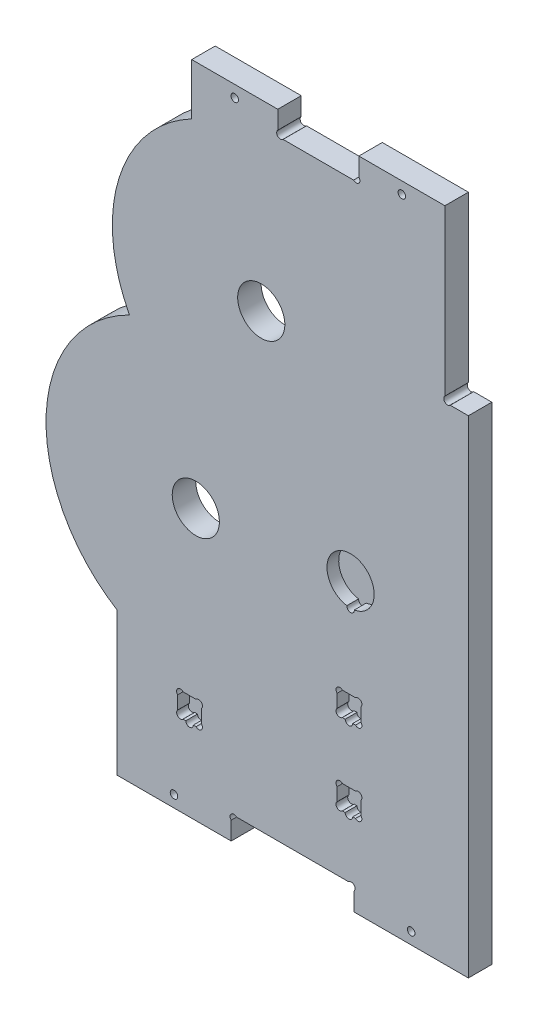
from build123d import *

# Parameters (mm, degrees)
BOSS_EXTRU_1_DEPTH      = 10
ESQUISSE2_R             = 10.05
ENL_V_MAT_EXTRU_1_DEPTH = 30
ENL_V_MAT_EXTRU_3_REACH = 172.898
ESQUISSE5_R             = 10.05
ESQUISSE6_R             = 1.6
ENL_V_MAT_EXTRU_4_DEPTH = 171.898361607
ENL_V_MAT_EXTRU_5_DEPTH = 171.898361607
ESQUISSE11_R            = 1.6
ENL_V_MAT_EXTRU_8_DEPTH = 171.898361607
BOSS_EXTRU_3_DEPTH      = 5


with BuildPart() as part:
    # Esquisse1 → Boss.-Extru.1 (new body)
    with BuildSketch(Plane.XY):
        with BuildLine():
            Line((-20.38, 118.107114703), (-20.38, 140))
            Line((-20.38, 140), (97.5, 140))
            Line((97.5, 140), (97.5, -140))
            Line((97.5, -140), (-52.322198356, -140))
            Line((-52.322198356, -140), (-52.322198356, -78.962700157))
            ThreePointArc((-52.322198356, -78.962700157), (-82.392092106, -21.658400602), (-46.914400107, 32.464742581))
            ThreePointArc((-46.914400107, 32.464742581), (-51.366626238, 80.775902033), (-20.38, 118.107114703))
        make_face()
        with BuildLine():
            Line((43.82068587, -105.17569864), (45.007944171, -105.17569864))
            ThreePointArc((45.007944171, -105.17569864), (46.607944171, -106.77569864), (48.207944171, -105.17569864))
            Line((48.207944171, -105.17569864), (49.395202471, -105.17569864))
            ThreePointArc((49.395202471, -105.17569864), (51.657944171, -105.17569864), (51.657944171, -102.91295694))
            Line((51.657944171, -102.91295694), (51.657944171, -97.338440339))
            ThreePointArc((51.657944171, -97.338440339), (51.657944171, -95.07569864), (49.395202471, -95.07569864))
            Line((49.395202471, -95.07569864), (43.82068587, -95.07569864))
            ThreePointArc((43.82068587, -95.07569864), (41.557944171, -95.07569864), (41.557944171, -97.338440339))
            Line((41.557944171, -97.338440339), (41.557944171, -102.91295694))
            ThreePointArc((41.557944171, -102.91295694), (41.557944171, -105.17569864), (43.82068587, -105.17569864))
        make_face(mode=Mode.SUBTRACT)
        with BuildLine():
            Line((-24.08641645, -105.27792365), (-22.91919132, -105.27792365))
            ThreePointArc((-22.91919132, -105.27792365), (-21.31919132, -106.87792365), (-19.71919132, -105.27792365))
            Line((-19.71919132, -105.27792365), (-18.55196619, -105.27792365))
            ThreePointArc((-18.55196619, -105.27792365), (-16.289313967, -105.298046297), (-16.26919132, -103.035394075))
            Line((-16.26919132, -103.035394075), (-16.26919132, -97.420453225))
            ThreePointArc((-16.26919132, -97.420453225), (-16.289313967, -95.157801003), (-18.55196619, -95.17792365))
            Line((-18.55196619, -95.17792365), (-24.08641645, -95.17792365))
            ThreePointArc((-24.08641645, -95.17792365), (-26.349068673, -95.157801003), (-26.36919132, -97.420453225))
            Line((-26.36919132, -97.420453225), (-26.36919132, -103.035394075))
            ThreePointArc((-26.36919132, -103.035394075), (-26.349068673, -105.298046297), (-24.08641645, -105.27792365))
        make_face(mode=Mode.SUBTRACT)
        with BuildLine():
            Line((43.82068587, -70.71085138), (45.007944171, -70.71085138))
            ThreePointArc((45.007944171, -70.71085138), (46.607944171, -72.31085138), (48.207944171, -70.71085138))
            Line((48.207944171, -70.71085138), (49.395202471, -70.71085138))
            ThreePointArc((49.395202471, -70.71085138), (51.657944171, -70.71085138), (51.657944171, -68.44810968))
            Line((51.657944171, -68.44810968), (51.657944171, -62.87359308))
            ThreePointArc((51.657944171, -62.87359308), (51.657944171, -60.61085138), (49.395202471, -60.61085138))
            Line((49.395202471, -60.61085138), (43.82068587, -60.61085138))
            ThreePointArc((43.82068587, -60.61085138), (41.557944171, -60.61085138), (41.557944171, -62.87359308))
            Line((41.557944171, -62.87359308), (41.557944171, -68.44810968))
            ThreePointArc((41.557944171, -68.44810968), (41.557944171, -70.71085138), (43.82068587, -70.71085138))
        make_face(mode=Mode.SUBTRACT)
        with BuildLine():
            ThreePointArc((48.894922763, -28.482636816), (47.3, -8.51), (45.705077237, -28.482636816))
            ThreePointArc((45.705077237, -28.482636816), (47.3, -30.21), (48.894922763, -28.482636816))
        make_face(mode=Mode.SUBTRACT)
    extrude(amount=BOSS_EXTRU_1_DEPTH)

    # Esquisse2 → Enl_v. mat.-Extru.1 (cut)
    with BuildSketch(Plane(origin=(0, 0, 0), x_dir=(-1, 0, 0), z_dir=(0, 0, -1))):
        with Locations((18.65, -24.75193273)):
            Circle(ESQUISSE2_R)
    extrude(amount=-ENL_V_MAT_EXTRU_1_DEPTH, mode=Mode.SUBTRACT)

    # Esquisse5 → Enl_v. mat.-Extru.3 (cut, up to next)
    with BuildSketch(Plane(origin=(0, 0, 0), x_dir=(-1, 0, 0), z_dir=(0, 0, -1)), mode=Mode.PRIVATE) as enl_v_mat_extru_3_sk1:
        with Locations((-9.23443436, 62)):
            Circle(ESQUISSE5_R)
    enl_v_mat_extru_3_tool1 = extrude(enl_v_mat_extru_3_sk1.sketch, amount=-ENL_V_MAT_EXTRU_3_REACH, mode=Mode.PRIVATE) & part.part
    add(enl_v_mat_extru_3_tool1.solids().sort_by_distance((9.234434, 62, 0))[0], mode=Mode.SUBTRACT)

    # Esquisse6 → Enl_v. mat.-Extru.4 (cut, through all)
    with BuildSketch(Plane.XY.offset(10)):
        with Locations((73.125, -135)):
            Circle(ESQUISSE6_R)
        with Locations(Location((-27.945, -135, 0), (0, 0, 180))):
            Circle(ESQUISSE6_R)
        with BuildLine():
            Line((-1.3072583, -130), (46.4872583, -130))
            ThreePointArc((46.4872583, -130), (48.753295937, -130.001098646), (48.75, -132.267134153))
            Line((48.75, -132.267134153), (48.75, -140))
            Line((48.75, -140), (-3.572198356, -140))
            Line((-3.572198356, -140), (-3.572198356, -132.264940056))
            ThreePointArc((-3.572198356, -132.264940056), (-3.572198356, -130), (-1.3072583, -130))
        make_face()
    extrude(amount=-ENL_V_MAT_EXTRU_4_DEPTH, mode=Mode.SUBTRACT)

    # Esquisse7 → Enl_v. mat.-Extru.5 (cut, through all)
    with BuildSketch(Plane.XY.offset(10)):
        with BuildLine():
            Line((87.5, 140), (87.5, 69.7627417))
            ThreePointArc((87.5, 69.7627417), (87.5, 67.5), (89.7627417, 67.5))
            Line((89.7627417, 67.5), (97.5, 67.5))
            Line((97.5, 67.5), (97.5, 140))
            Line((97.5, 140), (87.5, 140))
        make_face()
    extrude(amount=-ENL_V_MAT_EXTRU_5_DEPTH, mode=Mode.SUBTRACT)

    # Esquisse11 → Enl_v. mat.-Extru.8 (cut, through all)
    with BuildSketch(Plane(origin=(0, 0, 0), x_dir=(-1, 0, 0), z_dir=(0, 0, -1))):
        with Locations((-69.16, 135)):
            Circle(ESQUISSE11_R)
        with Locations(Location((2.06156334, 135, 0), (0, 0, 180))):
            Circle(ESQUISSE11_R)
        with BuildLine():
            Line((-50.82, 140), (-16.27843666, 140))
            Line((-16.27843666, 140), (-16.27843666, 132.2627417))
            ThreePointArc((-16.27843666, 132.2627417), (-16.27843666, 130), (-18.54117836, 130))
            Line((-18.54117836, 130), (-48.5572583, 130))
            ThreePointArc((-48.5572583, 130), (-50.82, 130), (-50.82, 132.2627417))
            Line((-50.82, 132.2627417), (-50.82, 140))
        make_face()
    extrude(amount=-ENL_V_MAT_EXTRU_8_DEPTH, mode=Mode.SUBTRACT)

    # Esquisse12 → Boss.-Extru.3 (add)
    with BuildSketch(Plane(origin=(0, 0, 0), x_dir=(-1, 0, 0), z_dir=(0, 0, -1))):
        Polygon((-62.459989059, -6.504421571), (-29.025057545, -6.504421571), (-29.025057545, -85.40889537), (35.182379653, -85.40889537), (35.182379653, -107.603318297), (-29.025057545, -107.603318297), (-62.459989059, -107.603318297), align=None)
    extrude(amount=-BOSS_EXTRU_3_DEPTH)


solid = part.part
